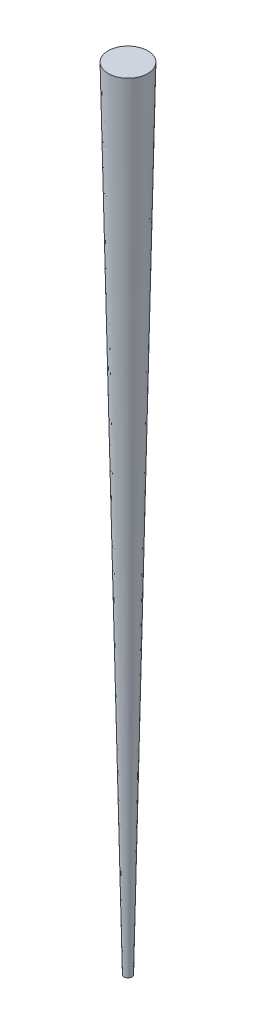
from build123d import *


with BuildPart() as part:
    # Sketch3 → Revolve1 (revolve)
    with BuildSketch(Plane.XY, mode=Mode.PRIVATE) as revolve1_sk:
        Polygon((0, 0), (0, 100), (2.5, 100), (0.5, 0), align=None)
    revolve(revolve1_sk.sketch.rotate(Axis((0, 0, 0), (0, 1, 0)), 270), axis=Axis((0, 0, 0), (0, 1, 0)))


solid = part.part
